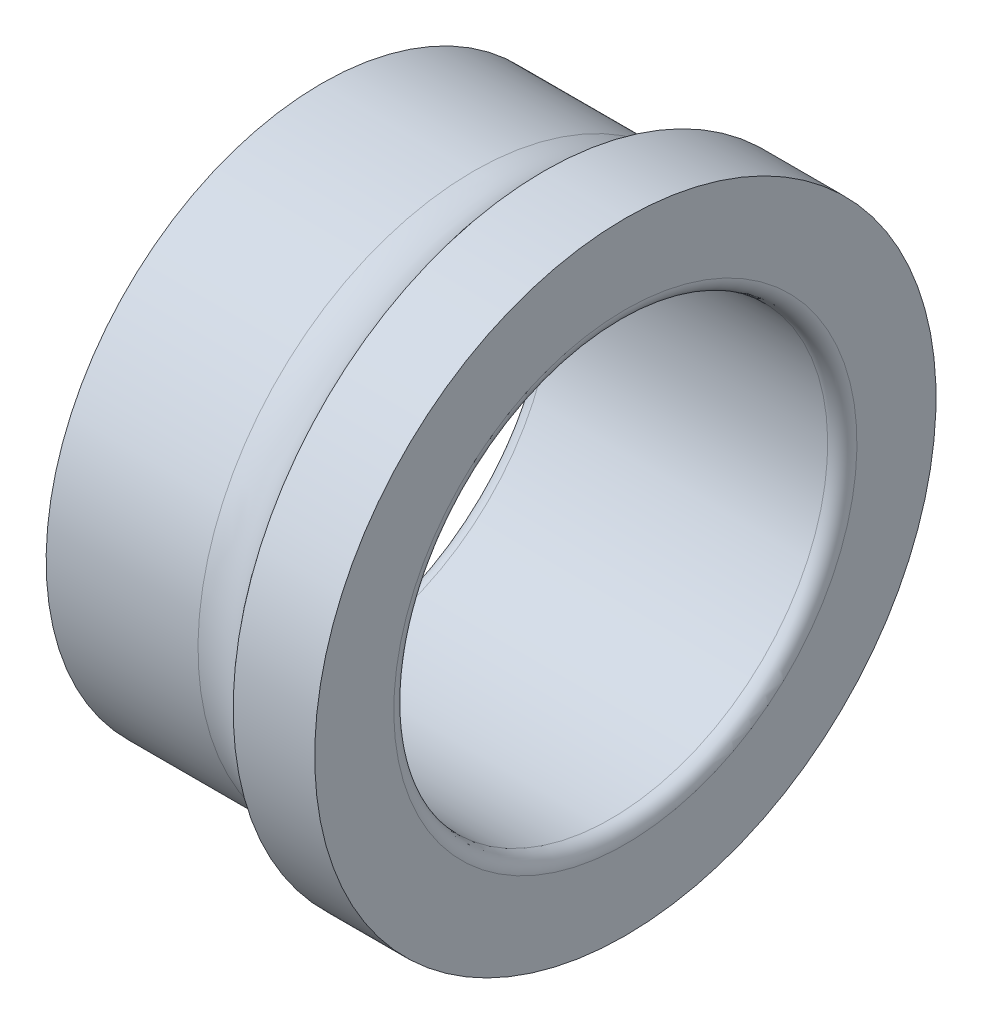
ISO-10303-21;
HEADER;
FILE_DESCRIPTION(('STEP AP214'),'2;1');
FILE_NAME('part.step','',(''),(''),'','','');
FILE_SCHEMA(('AUTOMOTIVE_DESIGN { 1 0 10303 214 1 1 1 1 }'));
ENDSEC;
DATA;
#1=APPLICATION_CONTEXT('core data for automotive mechanical design processes');
#2=APPLICATION_PROTOCOL_DEFINITION('international standard','automotive_design',2000,#1);
#3=PRODUCT_CONTEXT('',#1,'mechanical');
#4=PRODUCT('Part','Part','',(#3));
#5=PRODUCT_RELATED_PRODUCT_CATEGORY('part','',(#4));
#6=PRODUCT_DEFINITION_FORMATION('','',#4);
#7=PRODUCT_DEFINITION_CONTEXT('part definition',#1,'design');
#8=PRODUCT_DEFINITION('design','',#6,#7);
#9=PRODUCT_DEFINITION_SHAPE('','',#8);
#10=(LENGTH_UNIT() NAMED_UNIT(*) SI_UNIT(.MILLI.,.METRE.));
#11=(NAMED_UNIT(*) PLANE_ANGLE_UNIT() SI_UNIT($,.RADIAN.));
#12=(NAMED_UNIT(*) SI_UNIT($,.STERADIAN.) SOLID_ANGLE_UNIT());
#13=UNCERTAINTY_MEASURE_WITH_UNIT(LENGTH_MEASURE(1.E-05),#10,'distance_accuracy_value','');
#14=(GEOMETRIC_REPRESENTATION_CONTEXT(3) GLOBAL_UNCERTAINTY_ASSIGNED_CONTEXT((#13)) GLOBAL_UNIT_ASSIGNED_CONTEXT((#10,
#11,#12)) REPRESENTATION_CONTEXT('',''));
#15=CARTESIAN_POINT('',(0.,0.,0.));
#16=DIRECTION('',(0.,0.,1.));
#17=DIRECTION('',(1.,0.,0.));
#18=AXIS2_PLACEMENT_3D('',#15,#16,#17);
#19=CARTESIAN_POINT('',(0.,11.6875,0.));
#20=DIRECTION('',(-1.,0.,0.));
#21=DIRECTION('',(0.,0.,1.));
#22=AXIS2_PLACEMENT_3D('',#19,#20,#21);
#23=PLANE('',#22);
#24=CARTESIAN_POINT('',(0.,0.,0.));
#25=DIRECTION('',(-1.,0.,0.));
#26=DIRECTION('',(0.,1.,0.));
#27=AXIS2_PLACEMENT_3D('',#24,#25,#26);
#28=CIRCLE('',#27,10.675);
#29=CARTESIAN_POINT('',(0.,10.675,0.));
#30=VERTEX_POINT('',#29);
#31=EDGE_CURVE('E33',#30,#30,#28,.T.);
#32=ORIENTED_EDGE('',*,*,#31,.F.);
#33=EDGE_LOOP('',(#32));
#34=FACE_BOUND('',#33,.T.);
#35=CARTESIAN_POINT('',(0.,0.,0.));
#36=DIRECTION('',(-1.,0.,0.));
#37=DIRECTION('',(0.,1.,0.));
#38=AXIS2_PLACEMENT_3D('',#35,#36,#37);
#39=CIRCLE('',#38,12.7);
#40=CARTESIAN_POINT('',(0.,12.7,0.));
#41=VERTEX_POINT('',#40);
#42=EDGE_CURVE('E9',#41,#41,#39,.T.);
#43=ORIENTED_EDGE('',*,*,#42,.T.);
#44=EDGE_LOOP('',(#43));
#45=FACE_BOUND('',#44,.T.);
#46=ADVANCED_FACE('F14',(#34,#45),#23,.T.);
#47=CARTESIAN_POINT('',(14.,12.4975,0.));
#48=DIRECTION('',(1.,0.,0.));
#49=DIRECTION('',(0.,0.,-1.));
#50=AXIS2_PLACEMENT_3D('',#47,#48,#49);
#51=PLANE('',#50);
#52=CARTESIAN_POINT('',(14.,0.,0.));
#53=DIRECTION('',(-1.,0.,0.));
#54=DIRECTION('',(0.,1.,0.));
#55=AXIS2_PLACEMENT_3D('',#52,#53,#54);
#56=CIRCLE('',#55,10.675);
#57=CARTESIAN_POINT('',(14.,10.675,0.));
#58=VERTEX_POINT('',#57);
#59=EDGE_CURVE('E23',#58,#58,#56,.T.);
#60=ORIENTED_EDGE('',*,*,#59,.T.);
#61=EDGE_LOOP('',(#60));
#62=FACE_BOUND('',#61,.T.);
#63=CARTESIAN_POINT('',(14.,0.,0.));
#64=DIRECTION('',(-1.,0.,0.));
#65=DIRECTION('',(0.,1.,0.));
#66=AXIS2_PLACEMENT_3D('',#63,#64,#65);
#67=CIRCLE('',#66,14.32);
#68=CARTESIAN_POINT('',(14.,14.32,0.));
#69=VERTEX_POINT('',#68);
#70=EDGE_CURVE('E42',#69,#69,#67,.T.);
#71=ORIENTED_EDGE('',*,*,#70,.F.);
#72=EDGE_LOOP('',(#71));
#73=FACE_BOUND('',#72,.T.);
#74=ADVANCED_FACE('F51',(#62,#73),#51,.T.);
#75=CARTESIAN_POINT('',(0.675000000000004,0.,0.));
#76=DIRECTION('',(-1.,0.,0.));
#77=DIRECTION('',(0.,0.,1.));
#78=AXIS2_PLACEMENT_3D('',#75,#76,#77);
#79=TOROIDAL_SURFACE('',#78,10.675,0.675000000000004);
#80=ORIENTED_EDGE('',*,*,#31,.T.);
#81=EDGE_LOOP('',(#80));
#82=FACE_BOUND('',#81,.T.);
#83=CARTESIAN_POINT('',(0.675,0.,0.));
#84=DIRECTION('',(-1.,0.,0.));
#85=DIRECTION('',(0.,1.,0.));
#86=AXIS2_PLACEMENT_3D('',#83,#84,#85);
#87=CIRCLE('',#86,10.);
#88=CARTESIAN_POINT('',(0.675,10.,0.));
#89=VERTEX_POINT('',#88);
#90=EDGE_CURVE('E81',#89,#89,#87,.T.);
#91=ORIENTED_EDGE('',*,*,#90,.F.);
#92=EDGE_LOOP('',(#91));
#93=FACE_BOUND('',#92,.T.);
#94=ADVANCED_FACE('F47',(#82,#93),#79,.T.);
#95=CARTESIAN_POINT('',(7.,0.,0.));
#96=DIRECTION('',(-1.,0.,0.));
#97=DIRECTION('',(0.,0.,1.));
#98=AXIS2_PLACEMENT_3D('',#95,#96,#97);
#99=CYLINDRICAL_SURFACE('',#98,10.);
#100=CARTESIAN_POINT('',(13.325,0.,0.));
#101=DIRECTION('',(-1.,0.,0.));
#102=DIRECTION('',(0.,1.,0.));
#103=AXIS2_PLACEMENT_3D('',#100,#101,#102);
#104=CIRCLE('',#103,10.);
#105=CARTESIAN_POINT('',(13.325,10.,0.));
#106=VERTEX_POINT('',#105);
#107=EDGE_CURVE('E85',#106,#106,#104,.T.);
#108=ORIENTED_EDGE('',*,*,#107,.F.);
#109=EDGE_LOOP('',(#108));
#110=FACE_BOUND('',#109,.T.);
#111=ORIENTED_EDGE('',*,*,#90,.T.);
#112=EDGE_LOOP('',(#111));
#113=FACE_BOUND('',#112,.T.);
#114=ADVANCED_FACE('F16',(#110,#113),#99,.F.);
#115=CARTESIAN_POINT('',(13.325,0.,0.));
#116=DIRECTION('',(-1.,0.,0.));
#117=DIRECTION('',(0.,0.,1.));
#118=AXIS2_PLACEMENT_3D('',#115,#116,#117);
#119=TOROIDAL_SURFACE('',#118,10.675,0.674999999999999);
#120=ORIENTED_EDGE('',*,*,#107,.T.);
#121=EDGE_LOOP('',(#120));
#122=FACE_BOUND('',#121,.T.);
#123=ORIENTED_EDGE('',*,*,#59,.F.);
#124=EDGE_LOOP('',(#123));
#125=FACE_BOUND('',#124,.T.);
#126=ADVANCED_FACE('F54',(#122,#125),#119,.T.);
#127=CARTESIAN_POINT('',(12.12,0.,0.));
#128=DIRECTION('',(-1.,0.,0.));
#129=DIRECTION('',(0.,0.,1.));
#130=AXIS2_PLACEMENT_3D('',#127,#128,#129);
#131=CYLINDRICAL_SURFACE('',#130,14.32);
#132=CARTESIAN_POINT('',(10.24,0.,0.));
#133=DIRECTION('',(-1.,0.,0.));
#134=DIRECTION('',(0.,1.,0.));
#135=AXIS2_PLACEMENT_3D('',#132,#133,#134);
#136=CIRCLE('',#135,14.32);
#137=CARTESIAN_POINT('',(10.24,14.32,0.));
#138=VERTEX_POINT('',#137);
#139=EDGE_CURVE('E38',#138,#138,#136,.T.);
#140=ORIENTED_EDGE('',*,*,#139,.F.);
#141=EDGE_LOOP('',(#140));
#142=FACE_BOUND('',#141,.T.);
#143=ORIENTED_EDGE('',*,*,#70,.T.);
#144=EDGE_LOOP('',(#143));
#145=FACE_BOUND('',#144,.T.);
#146=ADVANCED_FACE('F57',(#142,#145),#131,.T.);
#147=CARTESIAN_POINT('',(7.,0.,0.));
#148=DIRECTION('',(-1.,0.,0.));
#149=DIRECTION('',(0.,0.,1.));
#150=AXIS2_PLACEMENT_3D('',#147,#148,#149);
#151=TOROIDAL_SURFACE('',#150,16.75,4.05);
#152=ORIENTED_EDGE('',*,*,#139,.T.);
#153=EDGE_LOOP('',(#152));
#154=FACE_BOUND('',#153,.T.);
#155=CARTESIAN_POINT('',(7.,0.,0.));
#156=DIRECTION('',(-1.,0.,0.));
#157=DIRECTION('',(0.,1.,0.));
#158=AXIS2_PLACEMENT_3D('',#155,#156,#157);
#159=CIRCLE('',#158,12.7);
#160=CARTESIAN_POINT('',(7.,12.7,0.));
#161=VERTEX_POINT('',#160);
#162=EDGE_CURVE('E43',#161,#161,#159,.T.);
#163=ORIENTED_EDGE('',*,*,#162,.F.);
#164=EDGE_LOOP('',(#163));
#165=FACE_BOUND('',#164,.T.);
#166=ADVANCED_FACE('F61',(#154,#165),#151,.F.);
#167=CARTESIAN_POINT('',(3.5,0.,0.));
#168=DIRECTION('',(-1.,0.,0.));
#169=DIRECTION('',(0.,0.,1.));
#170=AXIS2_PLACEMENT_3D('',#167,#168,#169);
#171=CYLINDRICAL_SURFACE('',#170,12.7);
#172=ORIENTED_EDGE('',*,*,#42,.F.);
#173=EDGE_LOOP('',(#172));
#174=FACE_BOUND('',#173,.T.);
#175=ORIENTED_EDGE('',*,*,#162,.T.);
#176=EDGE_LOOP('',(#175));
#177=FACE_BOUND('',#176,.T.);
#178=ADVANCED_FACE('F64',(#174,#177),#171,.T.);
#179=CLOSED_SHELL('',(#46,#74,#94,#114,#126,#146,#166,#178));
#180=MANIFOLD_SOLID_BREP('B1',#179);
#181=ADVANCED_BREP_SHAPE_REPRESENTATION('',(#18,#180),#14);
#182=SHAPE_DEFINITION_REPRESENTATION(#9,#181);
ENDSEC;
END-ISO-10303-21;
